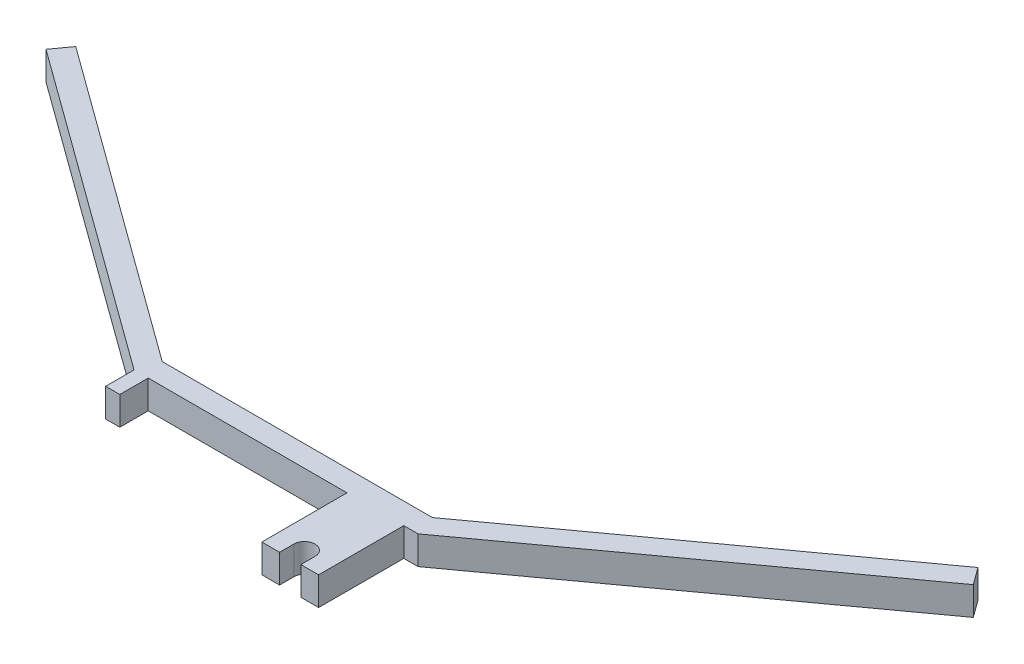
ISO-10303-21;
HEADER;
FILE_DESCRIPTION(('STEP AP214'),'2;1');
FILE_NAME('part.step','',(''),(''),'','','');
FILE_SCHEMA(('AUTOMOTIVE_DESIGN { 1 0 10303 214 1 1 1 1 }'));
ENDSEC;
DATA;
#1=APPLICATION_CONTEXT('core data for automotive mechanical design processes');
#2=APPLICATION_PROTOCOL_DEFINITION('international standard','automotive_design',2000,#1);
#3=PRODUCT_CONTEXT('',#1,'mechanical');
#4=PRODUCT('Part','Part','',(#3));
#5=PRODUCT_RELATED_PRODUCT_CATEGORY('part','',(#4));
#6=PRODUCT_DEFINITION_FORMATION('','',#4);
#7=PRODUCT_DEFINITION_CONTEXT('part definition',#1,'design');
#8=PRODUCT_DEFINITION('design','',#6,#7);
#9=PRODUCT_DEFINITION_SHAPE('','',#8);
#10=(LENGTH_UNIT() NAMED_UNIT(*) SI_UNIT(.MILLI.,.METRE.));
#11=(NAMED_UNIT(*) PLANE_ANGLE_UNIT() SI_UNIT($,.RADIAN.));
#12=(NAMED_UNIT(*) SI_UNIT($,.STERADIAN.) SOLID_ANGLE_UNIT());
#13=UNCERTAINTY_MEASURE_WITH_UNIT(LENGTH_MEASURE(1.E-05),#10,'distance_accuracy_value','');
#14=(GEOMETRIC_REPRESENTATION_CONTEXT(3) GLOBAL_UNCERTAINTY_ASSIGNED_CONTEXT((#13)) GLOBAL_UNIT_ASSIGNED_CONTEXT((#10,
#11,#12)) REPRESENTATION_CONTEXT('',''));
#15=CARTESIAN_POINT('',(0.,0.,0.));
#16=DIRECTION('',(0.,0.,1.));
#17=DIRECTION('',(1.,0.,0.));
#18=AXIS2_PLACEMENT_3D('',#15,#16,#17);
#19=CARTESIAN_POINT('',(8.99999999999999,8.21110255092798,52.5));
#20=DIRECTION('',(0.,0.,1.));
#21=DIRECTION('',(1.,0.,0.));
#22=AXIS2_PLACEMENT_3D('',#19,#20,#21);
#23=PLANE('',#22);
#24=DIRECTION('',(0.,-1.,0.));
#25=VECTOR('',#24,1.);
#26=CARTESIAN_POINT('',(6.24999999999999,8.21110255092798,52.5));
#27=LINE('',#26,#25);
#28=CARTESIAN_POINT('',(6.24999999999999,1.,52.5));
#29=VERTEX_POINT('',#28);
#30=CARTESIAN_POINT('',(6.24999999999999,-1.,52.5));
#31=VERTEX_POINT('',#30);
#32=EDGE_CURVE('E11',#29,#31,#27,.T.);
#33=ORIENTED_EDGE('',*,*,#32,.F.);
#34=DIRECTION('',(-1.,0.,0.));
#35=VECTOR('',#34,1.);
#36=CARTESIAN_POINT('',(8.99999999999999,1.,52.5));
#37=LINE('',#36,#35);
#38=CARTESIAN_POINT('',(4.99999999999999,1.,52.5));
#39=VERTEX_POINT('',#38);
#40=EDGE_CURVE('E215',#29,#39,#37,.T.);
#41=ORIENTED_EDGE('',*,*,#40,.T.);
#42=DIRECTION('',(0.,-1.,0.));
#43=VECTOR('',#42,1.);
#44=CARTESIAN_POINT('',(4.99999999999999,8.21110255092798,52.5));
#45=LINE('',#44,#43);
#46=CARTESIAN_POINT('',(4.99999999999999,-1.,52.5));
#47=VERTEX_POINT('',#46);
#48=EDGE_CURVE('E212',#39,#47,#45,.T.);
#49=ORIENTED_EDGE('',*,*,#48,.T.);
#50=DIRECTION('',(-1.,0.,0.));
#51=VECTOR('',#50,1.);
#52=CARTESIAN_POINT('',(8.99999999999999,-1.,52.5));
#53=LINE('',#52,#51);
#54=EDGE_CURVE('E202',#31,#47,#53,.T.);
#55=ORIENTED_EDGE('',*,*,#54,.F.);
#56=EDGE_LOOP('',(#33,#41,#49,#55));
#57=FACE_BOUND('',#56,.T.);
#58=ADVANCED_FACE('F35',(#57),#23,.T.);
#59=CARTESIAN_POINT('',(-9.99999999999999,1.,46.5));
#60=DIRECTION('',(0.,0.,-1.));
#61=DIRECTION('',(-1.,0.,0.));
#62=AXIS2_PLACEMENT_3D('',#59,#60,#61);
#63=PLANE('',#62);
#64=DIRECTION('',(1.,0.,0.));
#65=VECTOR('',#64,1.);
#66=CARTESIAN_POINT('',(-9.99999999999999,1.,46.5));
#67=LINE('',#66,#65);
#68=CARTESIAN_POINT('',(8.99999999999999,1.,46.5));
#69=VERTEX_POINT('',#68);
#70=CARTESIAN_POINT('',(9.99999999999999,1.,46.5));
#71=VERTEX_POINT('',#70);
#72=EDGE_CURVE('E58',#69,#71,#67,.T.);
#73=ORIENTED_EDGE('',*,*,#72,.F.);
#74=DIRECTION('',(0.,-1.,0.));
#75=VECTOR('',#74,1.);
#76=CARTESIAN_POINT('',(8.99999999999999,8.21110255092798,46.5));
#77=LINE('',#76,#75);
#78=CARTESIAN_POINT('',(8.99999999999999,-1.,46.5));
#79=VERTEX_POINT('',#78);
#80=EDGE_CURVE('E218',#69,#79,#77,.T.);
#81=ORIENTED_EDGE('',*,*,#80,.T.);
#82=DIRECTION('',(1.,0.,0.));
#83=VECTOR('',#82,1.);
#84=CARTESIAN_POINT('',(-9.99999999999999,-1.,46.5));
#85=LINE('',#84,#83);
#86=CARTESIAN_POINT('',(9.99999999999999,-1.,46.5));
#87=VERTEX_POINT('',#86);
#88=EDGE_CURVE('E271',#79,#87,#85,.T.);
#89=ORIENTED_EDGE('',*,*,#88,.T.);
#90=DIRECTION('',(0.,-1.,0.));
#91=VECTOR('',#90,1.);
#92=CARTESIAN_POINT('',(10.,1.,46.5));
#93=LINE('',#92,#91);
#94=EDGE_CURVE('E297',#71,#87,#93,.T.);
#95=ORIENTED_EDGE('',*,*,#94,.F.);
#96=EDGE_LOOP('',(#73,#81,#89,#95));
#97=FACE_BOUND('',#96,.T.);
#98=ADVANCED_FACE('F348',(#97),#63,.F.);
#99=CARTESIAN_POINT('',(-8.99999999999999,-1.,46.5));
#100=VERTEX_POINT('',#99);
#101=CARTESIAN_POINT('',(4.99999999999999,-1.,46.5));
#102=VERTEX_POINT('',#101);
#103=EDGE_CURVE('E272',#100,#102,#85,.T.);
#104=ORIENTED_EDGE('',*,*,#103,.T.);
#105=DIRECTION('',(0.,-1.,0.));
#106=VECTOR('',#105,1.);
#107=CARTESIAN_POINT('',(4.99999999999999,8.21110255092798,46.5));
#108=LINE('',#107,#106);
#109=CARTESIAN_POINT('',(4.99999999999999,1.,46.5));
#110=VERTEX_POINT('',#109);
#111=EDGE_CURVE('E211',#110,#102,#108,.T.);
#112=ORIENTED_EDGE('',*,*,#111,.F.);
#113=CARTESIAN_POINT('',(-8.99999999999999,1.,46.5));
#114=VERTEX_POINT('',#113);
#115=EDGE_CURVE('E253',#114,#110,#67,.T.);
#116=ORIENTED_EDGE('',*,*,#115,.F.);
#117=DIRECTION('',(0.,1.,0.));
#118=VECTOR('',#117,1.);
#119=CARTESIAN_POINT('',(-8.99999999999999,-3.23606797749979,46.5));
#120=LINE('',#119,#118);
#121=EDGE_CURVE('E227',#100,#114,#120,.T.);
#122=ORIENTED_EDGE('',*,*,#121,.F.);
#123=EDGE_LOOP('',(#104,#112,#116,#122));
#124=FACE_BOUND('',#123,.T.);
#125=ADVANCED_FACE('F388',(#124),#63,.F.);
#126=CARTESIAN_POINT('',(-31.7734222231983,1.,28.831720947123));
#127=DIRECTION('',(0.809104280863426,0.,0.587665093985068));
#128=DIRECTION('',(0.587665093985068,0.,-0.809104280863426));
#129=AXIS2_PLACEMENT_3D('',#126,#127,#128);
#130=PLANE('',#129);
#131=DIRECTION('',(-0.587665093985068,0.,0.809104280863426));
#132=VECTOR('',#131,1.);
#133=CARTESIAN_POINT('',(-31.7734222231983,-1.,28.831720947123));
#134=LINE('',#133,#132);
#135=CARTESIAN_POINT('',(-31.7734222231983,-1.,28.831720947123));
#136=VERTEX_POINT('',#135);
#137=CARTESIAN_POINT('',(-32.6549198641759,-1.,30.0453773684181));
#138=VERTEX_POINT('',#137);
#139=EDGE_CURVE('E246',#136,#138,#134,.T.);
#140=ORIENTED_EDGE('',*,*,#139,.T.);
#141=DIRECTION('',(0.,-1.,0.));
#142=VECTOR('',#141,1.);
#143=CARTESIAN_POINT('',(-32.6549198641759,1.,30.0453773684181));
#144=LINE('',#143,#142);
#145=CARTESIAN_POINT('',(-32.6549198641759,1.,30.0453773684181));
#146=VERTEX_POINT('',#145);
#147=EDGE_CURVE('E303',#146,#138,#144,.T.);
#148=ORIENTED_EDGE('',*,*,#147,.F.);
#149=DIRECTION('',(-0.587665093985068,0.,0.809104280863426));
#150=VECTOR('',#149,1.);
#151=CARTESIAN_POINT('',(-31.7734222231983,1.,28.831720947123));
#152=LINE('',#151,#150);
#153=CARTESIAN_POINT('',(-31.7734222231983,1.,28.831720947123));
#154=VERTEX_POINT('',#153);
#155=EDGE_CURVE('E247',#154,#146,#152,.T.);
#156=ORIENTED_EDGE('',*,*,#155,.F.);
#157=DIRECTION('',(0.,-1.,0.));
#158=VECTOR('',#157,1.);
#159=CARTESIAN_POINT('',(-31.7734222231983,1.,28.831720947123));
#160=LINE('',#159,#158);
#161=EDGE_CURVE('E266',#154,#136,#160,.T.);
#162=ORIENTED_EDGE('',*,*,#161,.T.);
#163=EDGE_LOOP('',(#140,#148,#156,#162));
#164=FACE_BOUND('',#163,.T.);
#165=ADVANCED_FACE('F37',(#164),#130,.F.);
#166=CARTESIAN_POINT('',(-32.6549198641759,1.,30.0453773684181));
#167=DIRECTION('',(0.587665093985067,0.,-0.809104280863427));
#168=DIRECTION('',(-0.809104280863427,0.,-0.587665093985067));
#169=AXIS2_PLACEMENT_3D('',#166,#167,#168);
#170=PLANE('',#169);
#171=DIRECTION('',(0.809104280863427,0.,0.587665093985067));
#172=VECTOR('',#171,1.);
#173=CARTESIAN_POINT('',(-32.6549198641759,-1.,30.0453773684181));
#174=LINE('',#173,#172);
#175=CARTESIAN_POINT('',(-9.99999999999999,-1.,46.5));
#176=VERTEX_POINT('',#175);
#177=EDGE_CURVE('E269',#138,#176,#174,.T.);
#178=ORIENTED_EDGE('',*,*,#177,.T.);
#179=DIRECTION('',(0.,-1.,0.));
#180=VECTOR('',#179,1.);
#181=CARTESIAN_POINT('',(-9.99999999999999,1.,46.5));
#182=LINE('',#181,#180);
#183=CARTESIAN_POINT('',(-9.99999999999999,1.,46.5));
#184=VERTEX_POINT('',#183);
#185=EDGE_CURVE('E300',#184,#176,#182,.T.);
#186=ORIENTED_EDGE('',*,*,#185,.F.);
#187=DIRECTION('',(0.809104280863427,0.,0.587665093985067));
#188=VECTOR('',#187,1.);
#189=CARTESIAN_POINT('',(-32.6549198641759,1.,30.0453773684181));
#190=LINE('',#189,#188);
#191=EDGE_CURVE('E250',#146,#184,#190,.T.);
#192=ORIENTED_EDGE('',*,*,#191,.F.);
#193=ORIENTED_EDGE('',*,*,#147,.T.);
#194=EDGE_LOOP('',(#178,#186,#192,#193));
#195=FACE_BOUND('',#194,.T.);
#196=ADVANCED_FACE('F307',(#195),#170,.F.);
#197=CARTESIAN_POINT('',(32.654919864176,1.,30.0453773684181));
#198=DIRECTION('',(-0.587665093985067,0.,-0.809104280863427));
#199=DIRECTION('',(-0.809104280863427,0.,0.587665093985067));
#200=AXIS2_PLACEMENT_3D('',#197,#198,#199);
#201=PLANE('',#200);
#202=DIRECTION('',(0.809104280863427,0.,-0.587665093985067));
#203=VECTOR('',#202,1.);
#204=CARTESIAN_POINT('',(32.654919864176,-1.,30.0453773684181));
#205=LINE('',#204,#203);
#206=CARTESIAN_POINT('',(32.654919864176,-1.,30.0453773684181));
#207=VERTEX_POINT('',#206);
#208=EDGE_CURVE('E274',#87,#207,#205,.T.);
#209=ORIENTED_EDGE('',*,*,#208,.T.);
#210=DIRECTION('',(0.,-1.,0.));
#211=VECTOR('',#210,1.);
#212=CARTESIAN_POINT('',(32.654919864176,1.,30.0453773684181));
#213=LINE('',#212,#211);
#214=CARTESIAN_POINT('',(32.654919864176,1.,30.0453773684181));
#215=VERTEX_POINT('',#214);
#216=EDGE_CURVE('E294',#215,#207,#213,.T.);
#217=ORIENTED_EDGE('',*,*,#216,.F.);
#218=DIRECTION('',(0.809104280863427,0.,-0.587665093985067));
#219=VECTOR('',#218,1.);
#220=CARTESIAN_POINT('',(32.654919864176,1.,30.0453773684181));
#221=LINE('',#220,#219);
#222=EDGE_CURVE('E256',#71,#215,#221,.T.);
#223=ORIENTED_EDGE('',*,*,#222,.F.);
#224=ORIENTED_EDGE('',*,*,#94,.T.);
#225=EDGE_LOOP('',(#209,#217,#223,#224));
#226=FACE_BOUND('',#225,.T.);
#227=ADVANCED_FACE('F345',(#226),#201,.F.);
#228=CARTESIAN_POINT('',(31.7734222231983,1.,28.831720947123));
#229=DIRECTION('',(-0.809104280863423,0.,0.587665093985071));
#230=DIRECTION('',(0.587665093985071,0.,0.809104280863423));
#231=AXIS2_PLACEMENT_3D('',#228,#229,#230);
#232=PLANE('',#231);
#233=DIRECTION('',(-0.587665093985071,0.,-0.809104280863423));
#234=VECTOR('',#233,1.);
#235=CARTESIAN_POINT('',(31.7734222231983,-1.,28.831720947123));
#236=LINE('',#235,#234);
#237=CARTESIAN_POINT('',(31.7734222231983,-1.,28.831720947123));
#238=VERTEX_POINT('',#237);
#239=EDGE_CURVE('E276',#207,#238,#236,.T.);
#240=ORIENTED_EDGE('',*,*,#239,.T.);
#241=DIRECTION('',(0.,-1.,0.));
#242=VECTOR('',#241,1.);
#243=CARTESIAN_POINT('',(31.7734222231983,1.,28.831720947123));
#244=LINE('',#243,#242);
#245=CARTESIAN_POINT('',(31.7734222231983,1.,28.831720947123));
#246=VERTEX_POINT('',#245);
#247=EDGE_CURVE('E291',#246,#238,#244,.T.);
#248=ORIENTED_EDGE('',*,*,#247,.F.);
#249=DIRECTION('',(-0.587665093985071,0.,-0.809104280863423));
#250=VECTOR('',#249,1.);
#251=CARTESIAN_POINT('',(31.7734222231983,1.,28.831720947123));
#252=LINE('',#251,#250);
#253=EDGE_CURVE('E258',#215,#246,#252,.T.);
#254=ORIENTED_EDGE('',*,*,#253,.F.);
#255=ORIENTED_EDGE('',*,*,#216,.T.);
#256=EDGE_LOOP('',(#240,#248,#254,#255));
#257=FACE_BOUND('',#256,.T.);
#258=ADVANCED_FACE('F341',(#257),#232,.F.);
#259=CARTESIAN_POINT('',(31.7734222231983,1.,28.831720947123));
#260=DIRECTION('',(0.587665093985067,0.,0.809104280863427));
#261=DIRECTION('',(0.809104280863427,0.,-0.587665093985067));
#262=AXIS2_PLACEMENT_3D('',#259,#260,#261);
#263=PLANE('',#262);
#264=DIRECTION('',(-0.809104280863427,0.,0.587665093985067));
#265=VECTOR('',#264,1.);
#266=CARTESIAN_POINT('',(31.7734222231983,-1.,28.831720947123));
#267=LINE('',#266,#265);
#268=CARTESIAN_POINT('',(9.51274359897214,-1.,45.));
#269=VERTEX_POINT('',#268);
#270=EDGE_CURVE('E278',#238,#269,#267,.T.);
#271=ORIENTED_EDGE('',*,*,#270,.T.);
#272=DIRECTION('',(0.,-1.,0.));
#273=VECTOR('',#272,1.);
#274=CARTESIAN_POINT('',(9.51274359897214,1.,45.));
#275=LINE('',#274,#273);
#276=CARTESIAN_POINT('',(9.51274359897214,1.,45.));
#277=VERTEX_POINT('',#276);
#278=EDGE_CURVE('E288',#277,#269,#275,.T.);
#279=ORIENTED_EDGE('',*,*,#278,.F.);
#280=DIRECTION('',(-0.809104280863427,0.,0.587665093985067));
#281=VECTOR('',#280,1.);
#282=CARTESIAN_POINT('',(31.7734222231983,1.,28.831720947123));
#283=LINE('',#282,#281);
#284=EDGE_CURVE('E260',#246,#277,#283,.T.);
#285=ORIENTED_EDGE('',*,*,#284,.F.);
#286=ORIENTED_EDGE('',*,*,#247,.T.);
#287=EDGE_LOOP('',(#271,#279,#285,#286));
#288=FACE_BOUND('',#287,.T.);
#289=ADVANCED_FACE('F336',(#288),#263,.F.);
#290=CARTESIAN_POINT('',(-9.51274359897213,1.,45.));
#291=DIRECTION('',(0.,0.,1.));
#292=DIRECTION('',(1.,0.,0.));
#293=AXIS2_PLACEMENT_3D('',#290,#291,#292);
#294=PLANE('',#293);
#295=DIRECTION('',(-1.,0.,0.));
#296=VECTOR('',#295,1.);
#297=CARTESIAN_POINT('',(-9.51274359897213,-1.,45.));
#298=LINE('',#297,#296);
#299=CARTESIAN_POINT('',(-9.51274359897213,-1.,45.));
#300=VERTEX_POINT('',#299);
#301=EDGE_CURVE('E280',#269,#300,#298,.T.);
#302=ORIENTED_EDGE('',*,*,#301,.T.);
#303=DIRECTION('',(0.,-1.,0.));
#304=VECTOR('',#303,1.);
#305=CARTESIAN_POINT('',(-9.51274359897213,1.,45.));
#306=LINE('',#305,#304);
#307=CARTESIAN_POINT('',(-9.51274359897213,1.,45.));
#308=VERTEX_POINT('',#307);
#309=EDGE_CURVE('E285',#308,#300,#306,.T.);
#310=ORIENTED_EDGE('',*,*,#309,.F.);
#311=DIRECTION('',(-1.,0.,0.));
#312=VECTOR('',#311,1.);
#313=CARTESIAN_POINT('',(-9.51274359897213,1.,45.));
#314=LINE('',#313,#312);
#315=EDGE_CURVE('E262',#277,#308,#314,.T.);
#316=ORIENTED_EDGE('',*,*,#315,.F.);
#317=ORIENTED_EDGE('',*,*,#278,.T.);
#318=EDGE_LOOP('',(#302,#310,#316,#317));
#319=FACE_BOUND('',#318,.T.);
#320=ADVANCED_FACE('F330',(#319),#294,.F.);
#321=CARTESIAN_POINT('',(-31.7734222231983,1.,28.831720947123));
#322=DIRECTION('',(-0.587665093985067,0.,0.809104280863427));
#323=DIRECTION('',(0.809104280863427,0.,0.587665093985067));
#324=AXIS2_PLACEMENT_3D('',#321,#322,#323);
#325=PLANE('',#324);
#326=DIRECTION('',(-0.809104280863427,0.,-0.587665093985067));
#327=VECTOR('',#326,1.);
#328=CARTESIAN_POINT('',(-31.7734222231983,-1.,28.831720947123));
#329=LINE('',#328,#327);
#330=EDGE_CURVE('E251',#300,#136,#329,.T.);
#331=ORIENTED_EDGE('',*,*,#330,.T.);
#332=ORIENTED_EDGE('',*,*,#161,.F.);
#333=DIRECTION('',(-0.809104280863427,0.,-0.587665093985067));
#334=VECTOR('',#333,1.);
#335=CARTESIAN_POINT('',(-31.7734222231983,1.,28.831720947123));
#336=LINE('',#335,#334);
#337=EDGE_CURVE('E264',#308,#154,#336,.T.);
#338=ORIENTED_EDGE('',*,*,#337,.F.);
#339=ORIENTED_EDGE('',*,*,#309,.T.);
#340=EDGE_LOOP('',(#331,#332,#338,#339));
#341=FACE_BOUND('',#340,.T.);
#342=ADVANCED_FACE('F328',(#341),#325,.F.);
#343=CARTESIAN_POINT('',(0.,1.,0.));
#344=DIRECTION('',(0.,1.,0.));
#345=DIRECTION('',(0.,0.,1.));
#346=AXIS2_PLACEMENT_3D('',#343,#344,#345);
#347=PLANE('',#346);
#348=DIRECTION('',(0.,0.,-1.));
#349=VECTOR('',#348,1.);
#350=CARTESIAN_POINT('',(6.24999999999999,1.,51.5));
#351=LINE('',#350,#349);
#352=CARTESIAN_POINT('',(6.24999999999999,1.,51.5));
#353=VERTEX_POINT('',#352);
#354=EDGE_CURVE('E176',#29,#353,#351,.T.);
#355=ORIENTED_EDGE('',*,*,#354,.T.);
#356=CARTESIAN_POINT('',(6.99999999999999,1.,51.5));
#357=DIRECTION('',(0.,-1.,0.));
#358=DIRECTION('',(0.,0.,-1.));
#359=AXIS2_PLACEMENT_3D('',#356,#357,#358);
#360=CIRCLE('',#359,0.75);
#361=CARTESIAN_POINT('',(7.74999999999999,1.,51.5));
#362=VERTEX_POINT('',#361);
#363=EDGE_CURVE('E171',#353,#362,#360,.T.);
#364=ORIENTED_EDGE('',*,*,#363,.T.);
#365=DIRECTION('',(0.,0.,1.));
#366=VECTOR('',#365,1.);
#367=CARTESIAN_POINT('',(7.74999999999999,1.,54.5));
#368=LINE('',#367,#366);
#369=CARTESIAN_POINT('',(7.74999999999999,1.,52.5));
#370=VERTEX_POINT('',#369);
#371=EDGE_CURVE('E179',#362,#370,#368,.T.);
#372=ORIENTED_EDGE('',*,*,#371,.T.);
#373=CARTESIAN_POINT('',(8.99999999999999,1.,52.5));
#374=VERTEX_POINT('',#373);
#375=EDGE_CURVE('E213',#374,#370,#37,.T.);
#376=ORIENTED_EDGE('',*,*,#375,.F.);
#377=DIRECTION('',(0.,0.,1.));
#378=VECTOR('',#377,1.);
#379=CARTESIAN_POINT('',(8.99999999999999,1.,46.5));
#380=LINE('',#379,#378);
#381=EDGE_CURVE('E198',#69,#374,#380,.T.);
#382=ORIENTED_EDGE('',*,*,#381,.F.);
#383=ORIENTED_EDGE('',*,*,#72,.T.);
#384=ORIENTED_EDGE('',*,*,#222,.T.);
#385=ORIENTED_EDGE('',*,*,#253,.T.);
#386=ORIENTED_EDGE('',*,*,#284,.T.);
#387=ORIENTED_EDGE('',*,*,#315,.T.);
#388=ORIENTED_EDGE('',*,*,#337,.T.);
#389=ORIENTED_EDGE('',*,*,#155,.T.);
#390=ORIENTED_EDGE('',*,*,#191,.T.);
#391=DIRECTION('',(0.,0.,1.));
#392=VECTOR('',#391,1.);
#393=CARTESIAN_POINT('',(-9.99999999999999,1.,46.5));
#394=LINE('',#393,#392);
#395=CARTESIAN_POINT('',(-9.99999999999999,1.,48.5));
#396=VERTEX_POINT('',#395);
#397=EDGE_CURVE('E223',#184,#396,#394,.T.);
#398=ORIENTED_EDGE('',*,*,#397,.T.);
#399=DIRECTION('',(1.,0.,0.));
#400=VECTOR('',#399,1.);
#401=CARTESIAN_POINT('',(-9.99999999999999,1.,48.5));
#402=LINE('',#401,#400);
#403=CARTESIAN_POINT('',(-8.99999999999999,1.,48.5));
#404=VERTEX_POINT('',#403);
#405=EDGE_CURVE('E233',#396,#404,#402,.T.);
#406=ORIENTED_EDGE('',*,*,#405,.T.);
#407=DIRECTION('',(0.,0.,-1.));
#408=VECTOR('',#407,1.);
#409=CARTESIAN_POINT('',(-8.99999999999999,1.,46.5));
#410=LINE('',#409,#408);
#411=EDGE_CURVE('E236',#404,#114,#410,.T.);
#412=ORIENTED_EDGE('',*,*,#411,.T.);
#413=ORIENTED_EDGE('',*,*,#115,.T.);
#414=DIRECTION('',(0.,0.,-1.));
#415=VECTOR('',#414,1.);
#416=CARTESIAN_POINT('',(4.99999999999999,1.,52.5));
#417=LINE('',#416,#415);
#418=EDGE_CURVE('E208',#39,#110,#417,.T.);
#419=ORIENTED_EDGE('',*,*,#418,.F.);
#420=ORIENTED_EDGE('',*,*,#40,.F.);
#421=EDGE_LOOP('',(#355,#364,#372,#376,#382,#383,#384,#385,#386,#387,#388,#389,#390,#398,#406,
#412,#413,#419,#420));
#422=FACE_BOUND('',#421,.T.);
#423=ADVANCED_FACE('F184',(#422),#347,.T.);
#424=CARTESIAN_POINT('',(0.,-1.,0.));
#425=DIRECTION('',(0.,1.,0.));
#426=DIRECTION('',(0.,0.,1.));
#427=AXIS2_PLACEMENT_3D('',#424,#425,#426);
#428=PLANE('',#427);
#429=CARTESIAN_POINT('',(6.99999999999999,-1.,51.5));
#430=DIRECTION('',(0.,-1.,0.));
#431=DIRECTION('',(0.,0.,-1.));
#432=AXIS2_PLACEMENT_3D('',#429,#430,#431);
#433=CIRCLE('',#432,0.75);
#434=CARTESIAN_POINT('',(6.24999999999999,-1.,51.5));
#435=VERTEX_POINT('',#434);
#436=CARTESIAN_POINT('',(7.74999999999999,-1.,51.5));
#437=VERTEX_POINT('',#436);
#438=EDGE_CURVE('E174',#435,#437,#433,.T.);
#439=ORIENTED_EDGE('',*,*,#438,.F.);
#440=DIRECTION('',(0.,0.,-1.));
#441=VECTOR('',#440,1.);
#442=CARTESIAN_POINT('',(6.24999999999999,-1.,51.5));
#443=LINE('',#442,#441);
#444=EDGE_CURVE('E186',#31,#435,#443,.T.);
#445=ORIENTED_EDGE('',*,*,#444,.F.);
#446=ORIENTED_EDGE('',*,*,#54,.T.);
#447=DIRECTION('',(0.,0.,-1.));
#448=VECTOR('',#447,1.);
#449=CARTESIAN_POINT('',(4.99999999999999,-1.,52.5));
#450=LINE('',#449,#448);
#451=EDGE_CURVE('E195',#47,#102,#450,.T.);
#452=ORIENTED_EDGE('',*,*,#451,.T.);
#453=ORIENTED_EDGE('',*,*,#103,.F.);
#454=DIRECTION('',(0.,0.,1.));
#455=VECTOR('',#454,1.);
#456=CARTESIAN_POINT('',(-8.99999999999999,-1.,46.5));
#457=LINE('',#456,#455);
#458=CARTESIAN_POINT('',(-8.99999999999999,-1.,48.5));
#459=VERTEX_POINT('',#458);
#460=EDGE_CURVE('E224',#100,#459,#457,.T.);
#461=ORIENTED_EDGE('',*,*,#460,.T.);
#462=DIRECTION('',(-1.,0.,0.));
#463=VECTOR('',#462,1.);
#464=CARTESIAN_POINT('',(-9.99999999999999,-1.,48.5));
#465=LINE('',#464,#463);
#466=CARTESIAN_POINT('',(-9.99999999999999,-1.,48.5));
#467=VERTEX_POINT('',#466);
#468=EDGE_CURVE('E230',#459,#467,#465,.T.);
#469=ORIENTED_EDGE('',*,*,#468,.T.);
#470=DIRECTION('',(0.,0.,-1.));
#471=VECTOR('',#470,1.);
#472=CARTESIAN_POINT('',(-9.99999999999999,-1.,46.5));
#473=LINE('',#472,#471);
#474=EDGE_CURVE('E226',#467,#176,#473,.T.);
#475=ORIENTED_EDGE('',*,*,#474,.T.);
#476=ORIENTED_EDGE('',*,*,#177,.F.);
#477=ORIENTED_EDGE('',*,*,#139,.F.);
#478=ORIENTED_EDGE('',*,*,#330,.F.);
#479=ORIENTED_EDGE('',*,*,#301,.F.);
#480=ORIENTED_EDGE('',*,*,#270,.F.);
#481=ORIENTED_EDGE('',*,*,#239,.F.);
#482=ORIENTED_EDGE('',*,*,#208,.F.);
#483=ORIENTED_EDGE('',*,*,#88,.F.);
#484=DIRECTION('',(0.,0.,1.));
#485=VECTOR('',#484,1.);
#486=CARTESIAN_POINT('',(8.99999999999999,-1.,46.5));
#487=LINE('',#486,#485);
#488=CARTESIAN_POINT('',(8.99999999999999,-1.,52.5));
#489=VERTEX_POINT('',#488);
#490=EDGE_CURVE('E193',#79,#489,#487,.T.);
#491=ORIENTED_EDGE('',*,*,#490,.T.);
#492=CARTESIAN_POINT('',(7.74999999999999,-1.,52.5));
#493=VERTEX_POINT('',#492);
#494=EDGE_CURVE('E199',#489,#493,#53,.T.);
#495=ORIENTED_EDGE('',*,*,#494,.T.);
#496=DIRECTION('',(0.,0.,1.));
#497=VECTOR('',#496,1.);
#498=CARTESIAN_POINT('',(7.74999999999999,-1.,54.5));
#499=LINE('',#498,#497);
#500=EDGE_CURVE('E50',#437,#493,#499,.T.);
#501=ORIENTED_EDGE('',*,*,#500,.F.);
#502=EDGE_LOOP('',(#439,#445,#446,#452,#453,#461,#469,#475,#476,#477,#478,#479,#480,#481,#482,
#483,#491,#495,#501));
#503=FACE_BOUND('',#502,.T.);
#504=ADVANCED_FACE('F315',(#503),#428,.F.);
#505=CARTESIAN_POINT('',(-9.99999999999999,-3.23606797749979,46.5));
#506=DIRECTION('',(-1.,0.,0.));
#507=DIRECTION('',(0.,0.,1.));
#508=AXIS2_PLACEMENT_3D('',#505,#506,#507);
#509=PLANE('',#508);
#510=ORIENTED_EDGE('',*,*,#474,.F.);
#511=DIRECTION('',(0.,1.,0.));
#512=VECTOR('',#511,1.);
#513=CARTESIAN_POINT('',(-9.99999999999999,-3.23606797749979,48.5));
#514=LINE('',#513,#512);
#515=EDGE_CURVE('E239',#467,#396,#514,.T.);
#516=ORIENTED_EDGE('',*,*,#515,.T.);
#517=ORIENTED_EDGE('',*,*,#397,.F.);
#518=ORIENTED_EDGE('',*,*,#185,.T.);
#519=EDGE_LOOP('',(#510,#516,#517,#518));
#520=FACE_BOUND('',#519,.T.);
#521=ADVANCED_FACE('F322',(#520),#509,.T.);
#522=CARTESIAN_POINT('',(-8.99999999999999,-3.23606797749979,46.5));
#523=DIRECTION('',(1.,0.,0.));
#524=DIRECTION('',(0.,0.,-1.));
#525=AXIS2_PLACEMENT_3D('',#522,#523,#524);
#526=PLANE('',#525);
#527=ORIENTED_EDGE('',*,*,#460,.F.);
#528=ORIENTED_EDGE('',*,*,#121,.T.);
#529=ORIENTED_EDGE('',*,*,#411,.F.);
#530=DIRECTION('',(0.,1.,0.));
#531=VECTOR('',#530,1.);
#532=CARTESIAN_POINT('',(-8.99999999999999,-3.23606797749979,48.5));
#533=LINE('',#532,#531);
#534=EDGE_CURVE('E242',#459,#404,#533,.T.);
#535=ORIENTED_EDGE('',*,*,#534,.F.);
#536=EDGE_LOOP('',(#527,#528,#529,#535));
#537=FACE_BOUND('',#536,.T.);
#538=ADVANCED_FACE('F370',(#537),#526,.T.);
#539=CARTESIAN_POINT('',(-9.99999999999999,-3.23606797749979,48.5));
#540=DIRECTION('',(0.,0.,1.));
#541=DIRECTION('',(1.,0.,0.));
#542=AXIS2_PLACEMENT_3D('',#539,#540,#541);
#543=PLANE('',#542);
#544=ORIENTED_EDGE('',*,*,#468,.F.);
#545=ORIENTED_EDGE('',*,*,#534,.T.);
#546=ORIENTED_EDGE('',*,*,#405,.F.);
#547=ORIENTED_EDGE('',*,*,#515,.F.);
#548=EDGE_LOOP('',(#544,#545,#546,#547));
#549=FACE_BOUND('',#548,.T.);
#550=ADVANCED_FACE('F373',(#549),#543,.T.);
#551=CARTESIAN_POINT('',(8.99999999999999,8.21110255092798,46.5));
#552=DIRECTION('',(1.,0.,0.));
#553=DIRECTION('',(0.,0.,-1.));
#554=AXIS2_PLACEMENT_3D('',#551,#552,#553);
#555=PLANE('',#554);
#556=ORIENTED_EDGE('',*,*,#80,.F.);
#557=ORIENTED_EDGE('',*,*,#381,.T.);
#558=DIRECTION('',(0.,-1.,0.));
#559=VECTOR('',#558,1.);
#560=CARTESIAN_POINT('',(8.99999999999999,8.21110255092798,52.5));
#561=LINE('',#560,#559);
#562=EDGE_CURVE('E207',#374,#489,#561,.T.);
#563=ORIENTED_EDGE('',*,*,#562,.T.);
#564=ORIENTED_EDGE('',*,*,#490,.F.);
#565=EDGE_LOOP('',(#556,#557,#563,#564));
#566=FACE_BOUND('',#565,.T.);
#567=ADVANCED_FACE('F350',(#566),#555,.T.);
#568=DIRECTION('',(0.,1.,0.));
#569=VECTOR('',#568,1.);
#570=CARTESIAN_POINT('',(7.74999999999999,8.21110255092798,52.5));
#571=LINE('',#570,#569);
#572=EDGE_CURVE('E43',#493,#370,#571,.T.);
#573=ORIENTED_EDGE('',*,*,#572,.F.);
#574=ORIENTED_EDGE('',*,*,#494,.F.);
#575=ORIENTED_EDGE('',*,*,#562,.F.);
#576=ORIENTED_EDGE('',*,*,#375,.T.);
#577=EDGE_LOOP('',(#573,#574,#575,#576));
#578=FACE_BOUND('',#577,.T.);
#579=ADVANCED_FACE('F354',(#578),#23,.T.);
#580=CARTESIAN_POINT('',(4.99999999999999,8.21110255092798,52.5));
#581=DIRECTION('',(-1.,0.,0.));
#582=DIRECTION('',(0.,0.,1.));
#583=AXIS2_PLACEMENT_3D('',#580,#581,#582);
#584=PLANE('',#583);
#585=ORIENTED_EDGE('',*,*,#48,.F.);
#586=ORIENTED_EDGE('',*,*,#418,.T.);
#587=ORIENTED_EDGE('',*,*,#111,.T.);
#588=ORIENTED_EDGE('',*,*,#451,.F.);
#589=EDGE_LOOP('',(#585,#586,#587,#588));
#590=FACE_BOUND('',#589,.T.);
#591=ADVANCED_FACE('F364',(#590),#584,.T.);
#592=CARTESIAN_POINT('',(6.99999999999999,1.,51.5));
#593=DIRECTION('',(0.,-1.,0.));
#594=DIRECTION('',(0.,0.,-1.));
#595=AXIS2_PLACEMENT_3D('',#592,#593,#594);
#596=CYLINDRICAL_SURFACE('',#595,0.75);
#597=ORIENTED_EDGE('',*,*,#438,.T.);
#598=DIRECTION('',(0.,-1.,0.));
#599=VECTOR('',#598,1.);
#600=CARTESIAN_POINT('',(7.74999999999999,1.,51.5));
#601=LINE('',#600,#599);
#602=EDGE_CURVE('E166',#362,#437,#601,.T.);
#603=ORIENTED_EDGE('',*,*,#602,.F.);
#604=ORIENTED_EDGE('',*,*,#363,.F.);
#605=DIRECTION('',(0.,-1.,0.));
#606=VECTOR('',#605,1.);
#607=CARTESIAN_POINT('',(6.24999999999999,1.,51.5));
#608=LINE('',#607,#606);
#609=EDGE_CURVE('E175',#353,#435,#608,.T.);
#610=ORIENTED_EDGE('',*,*,#609,.T.);
#611=EDGE_LOOP('',(#597,#603,#604,#610));
#612=FACE_BOUND('',#611,.T.);
#613=ADVANCED_FACE('F168',(#612),#596,.F.);
#614=CARTESIAN_POINT('',(6.24999999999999,1.,51.5));
#615=DIRECTION('',(-1.,0.,0.));
#616=DIRECTION('',(0.,0.,1.));
#617=AXIS2_PLACEMENT_3D('',#614,#615,#616);
#618=PLANE('',#617);
#619=ORIENTED_EDGE('',*,*,#32,.T.);
#620=ORIENTED_EDGE('',*,*,#444,.T.);
#621=ORIENTED_EDGE('',*,*,#609,.F.);
#622=ORIENTED_EDGE('',*,*,#354,.F.);
#623=EDGE_LOOP('',(#619,#620,#621,#622));
#624=FACE_BOUND('',#623,.T.);
#625=ADVANCED_FACE('F398',(#624),#618,.F.);
#626=CARTESIAN_POINT('',(7.74999999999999,1.,54.5));
#627=DIRECTION('',(1.,0.,0.));
#628=DIRECTION('',(0.,0.,-1.));
#629=AXIS2_PLACEMENT_3D('',#626,#627,#628);
#630=PLANE('',#629);
#631=ORIENTED_EDGE('',*,*,#572,.T.);
#632=ORIENTED_EDGE('',*,*,#371,.F.);
#633=ORIENTED_EDGE('',*,*,#602,.T.);
#634=ORIENTED_EDGE('',*,*,#500,.T.);
#635=EDGE_LOOP('',(#631,#632,#633,#634));
#636=FACE_BOUND('',#635,.T.);
#637=ADVANCED_FACE('F180',(#636),#630,.F.);
#638=CLOSED_SHELL('',(#58,#98,#125,#165,#196,#227,#258,#289,#320,#342,#423,#504,#521,#538,#550,
#567,#579,#591,#613,#625,#637));
#639=MANIFOLD_SOLID_BREP('B2',#638);
#640=ADVANCED_BREP_SHAPE_REPRESENTATION('',(#18,#639),#14);
#641=SHAPE_DEFINITION_REPRESENTATION(#9,#640);
ENDSEC;
END-ISO-10303-21;
